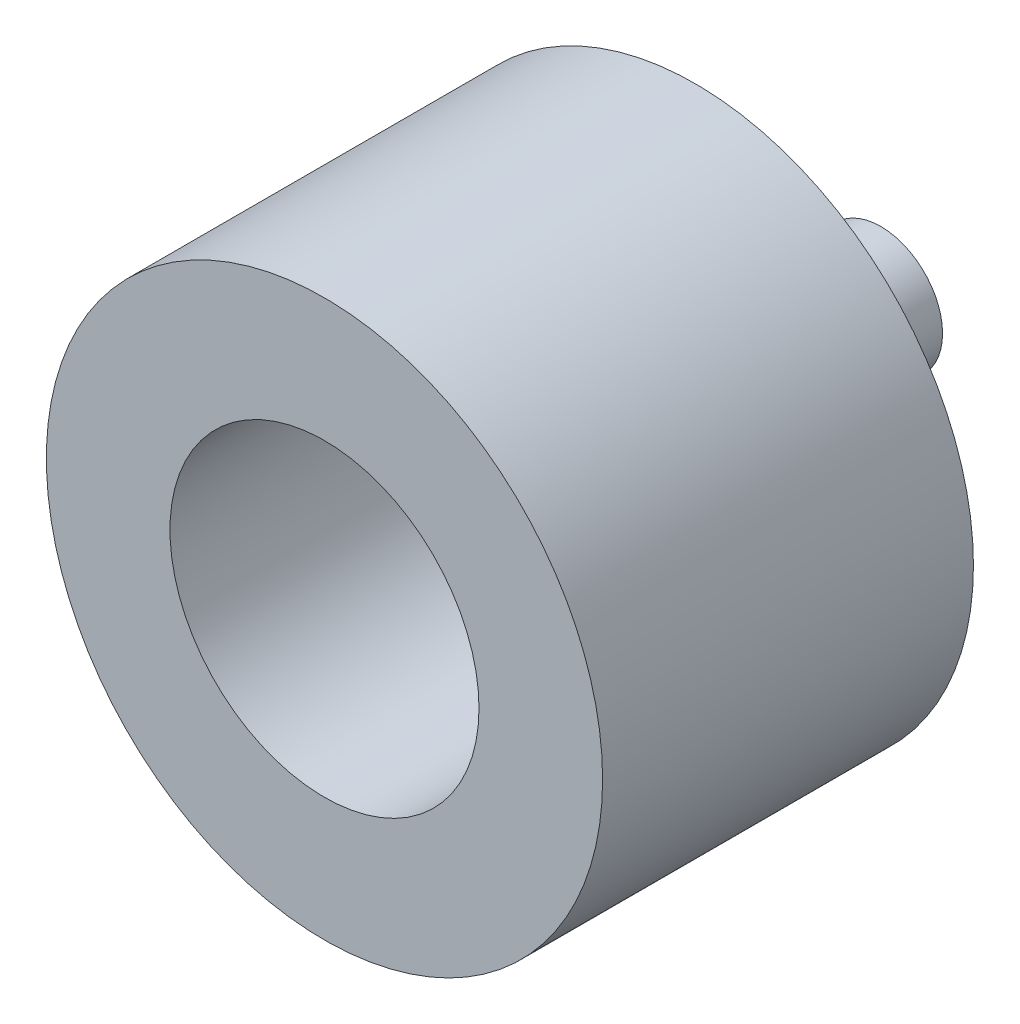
from build123d import *

# Parameters (mm, degrees)
CROQUIS1_R              = 4.5
SALIENTE_EXTRUIR1_DEPTH = 6
CROQUIS2_R              = 2.5
CORTAR_EXTRUIR1_DEPTH   = 5
CROQUIS3_R              = 1
SALIENTE_EXTRUIR2_DEPTH = 3


with BuildPart() as part:
    # Croquis1 → Saliente-Extruir1 (new body)
    with BuildSketch(Plane.XY):
        Circle(CROQUIS1_R)
    extrude(amount=SALIENTE_EXTRUIR1_DEPTH)

    # Croquis2 → Cortar-Extruir1 (cut)
    with BuildSketch(Plane.XY.offset(6)):
        Circle(CROQUIS2_R)
    extrude(amount=-CORTAR_EXTRUIR1_DEPTH, mode=Mode.SUBTRACT)

    # Croquis3 → Saliente-Extruir2 (add)
    with BuildSketch(Plane(origin=(0, 0, 0), x_dir=(-1, 0, 0), z_dir=(0, 0, -1))):
        with Locations(Location((0, 0, 0), (0, 0, 180))):
            Circle(CROQUIS3_R)
    extrude(amount=SALIENTE_EXTRUIR2_DEPTH)


solid = part.part
